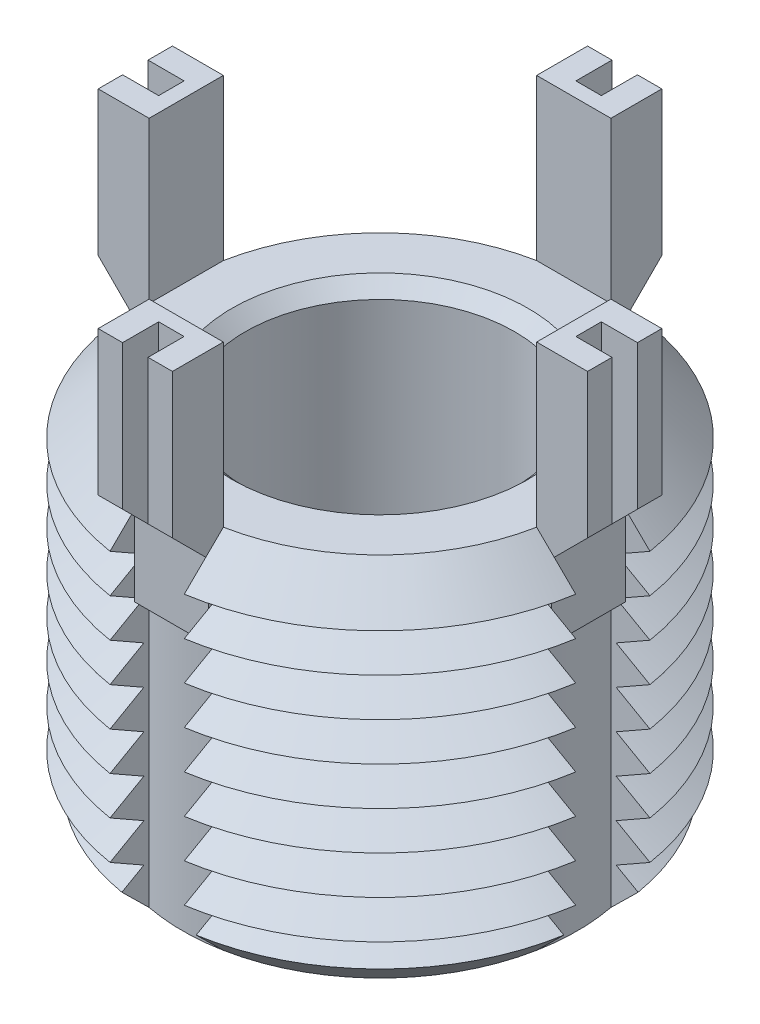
from build123d import *

# Parameters (mm, degrees)
SKETCH1_R               = 11.1125
BOSS_EXTRUDE1_DEPTH     = 17.272
CHAMFER1_SIZE           = 1.814
LPATTERN1_COUNT         = 8
LPATTERN1_PITCH         = 1.814
CUT_EXTRUDE1_REACH      = 25.352
CIRPATTERN1_COUNT       = 4
BOSS_EXTRUDE3_DEPTH     = 1.75
CIRPATTERN2_COUNT       = 4
CUT_EXTRUDE3_DEPTH      = 30.707213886
CUT_EXTRUDE3_DEPTH_BACK = 30.707213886
SKETCH6_W               = 1.7
SKETCH6_H               = 1.2
SKETCH6_W_2             = 1.2
SKETCH6_H_2             = 1.7
SKETCH7_R               = 6.35
CUT_EXTRUDE4_DEPTH      = 17.272
CHAMFER2_SIZE           = 0.635


with BuildPart() as part:
    # Sketch1 → Boss-Extrude1 (new body)
    with BuildSketch(Plane(origin=(0, 0, 0), x_dir=(1, 0, 0), z_dir=(0, 1, 0))):
        with Locations(Location((0, 0, 0), (0, 0, 270))):
            Circle(SKETCH1_R)
    extrude(amount=-BOSS_EXTRUDE1_DEPTH)

    # Chamfer1
    chamfer1_edges = [part.edges().sort_by_distance(p)[0] for p in [
        (0, 0, -11.1125),
        (0, -17.272, -11.1125),
    ]]
    chamfer(chamfer1_edges, length=CHAMFER1_SIZE)

    # Sketch3 → Cut-Revolve1 (revolve, cut)
    with BuildSketch(Plane(origin=(0, 0, 0), x_dir=(0, 0, -1), z_dir=(1, 0, 0))):
        Polygon((-11.1125, -1.814), (-9.541529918, -2.721), (-11.1125, -3.628), align=None)
    cut_revolve1 = revolve(axis=Axis((0, 0.885892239, 0), (0, -1, 0)), mode=Mode.SUBTRACT)

    # LPattern1: Cut-Revolve1 ×8
    with Locations(*[(0, -i * LPATTERN1_PITCH, 0) for i in range(1, LPATTERN1_COUNT)]):
        add(cut_revolve1, mode=Mode.SUBTRACT)

    # Cut-Extrude1: up to this cone (the profile starts inside it)
    cut_extrude1_end = Plane(origin=(0, 0, 0), z_dir=(0, 1, 0)).offset(-26.570499) * Cone(1e-06, 78.993, 78.992999, align=(Align.CENTER, Align.CENTER, Align.MIN), mode=Mode.PRIVATE)
    # Sketch4 → Cut-Extrude1 (cut, up to the surface)
    with BuildSketch(Plane(origin=(0, 0, 0), x_dir=(1, 0, 0), z_dir=(0, 1, 0)), mode=Mode.PRIVATE) as cut_extrude1_sk1:
        with BuildLine():
            Line((-9.132338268, 1.75), (-10.973839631, 1.75))
            ThreePointArc((-10.973839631, 1.75), (-11.1125, 0), (-10.973839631, -1.75))
            Line((-10.973839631, -1.75), (-9.132338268, -1.75))
            ThreePointArc((-9.132338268, -1.75), (-9.2985, 0), (-9.132338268, 1.75))
        make_face()
    cut_extrude1_tool1 = extrude(cut_extrude1_sk1.sketch, amount=-CUT_EXTRUDE1_REACH, mode=Mode.PRIVATE) & cut_extrude1_end
    cut_extrude1 = cut_extrude1_tool1.solids().sort_by_distance((-10.154651, 0, 0))[0]
    add(cut_extrude1, mode=Mode.SUBTRACT)

    # CirPattern1: Cut-Extrude1 ×4 about axis
    cirpattern1_axis = Axis((0, 0, 0), (0, 1, 0))
    for i in range(1, CIRPATTERN1_COUNT):
        add(cut_extrude1.rotate(cirpattern1_axis, i * 360 / CIRPATTERN1_COUNT), mode=Mode.SUBTRACT)

    # Sketch5 → Boss-Extrude3 (add, symmetric)
    with BuildSketch(Plane(origin=(0, 0, 0), x_dir=(0, 0, -1), z_dir=(1, 0, 0))):
        Polygon((-9.132338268, 7.558), (-9.132338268, -4.442), (-9.832338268, -4.442), (-9.832338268, -0.942), (-11.532338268, 0.758), (-11.532338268, 7.558), align=None)
    boss_extrude3 = extrude(amount=BOSS_EXTRUDE3_DEPTH, both=True)

    # CirPattern2: Boss-Extrude3 ×4 about axis
    cirpattern2_axis = Axis((0, 0, 0), (0, 1, 0))
    for i in range(1, CIRPATTERN2_COUNT):
        add(boss_extrude3.rotate(cirpattern2_axis, i * 360 / CIRPATTERN2_COUNT))

    # Sketch6 → Cut-Extrude3 (cut, two sides: drawn at the far end of the back side and taken through both)
    with BuildSketch(Plane(origin=(0, 7.558, 0), x_dir=(1, 0, 0), z_dir=(0, 1, 0)).offset(-CUT_EXTRUDE3_DEPTH_BACK)):
        with Locations((-10.682338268, 0)):
            Rectangle(SKETCH6_W, SKETCH6_H)
        with Locations((0, 10.682338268)):
            Rectangle(SKETCH6_W_2, SKETCH6_H_2)
        with Locations((10.682338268, 0)):
            Rectangle(SKETCH6_W, SKETCH6_H)
        with Locations((0, -10.682338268)):
            Rectangle(SKETCH6_W_2, SKETCH6_H_2)
    extrude(amount=CUT_EXTRUDE3_DEPTH + CUT_EXTRUDE3_DEPTH_BACK, mode=Mode.SUBTRACT)

    # Sketch7 → Cut-Extrude4 (cut)
    with BuildSketch(Plane(origin=(0, 0, 0), x_dir=(1, 0, 0), z_dir=(0, 1, 0))):
        with Locations(Location((0, 0, 0), (0, 0, 270))):
            Circle(SKETCH7_R)
    extrude(amount=-CUT_EXTRUDE4_DEPTH, mode=Mode.SUBTRACT)

    # Chamfer2
    chamfer2_edges = [part.edges().sort_by_distance(p)[0] for p in [
        (0, 0, -6.35),
        (0, -17.272, -6.35),
    ]]
    chamfer(chamfer2_edges, length=CHAMFER2_SIZE)


solid = part.part
